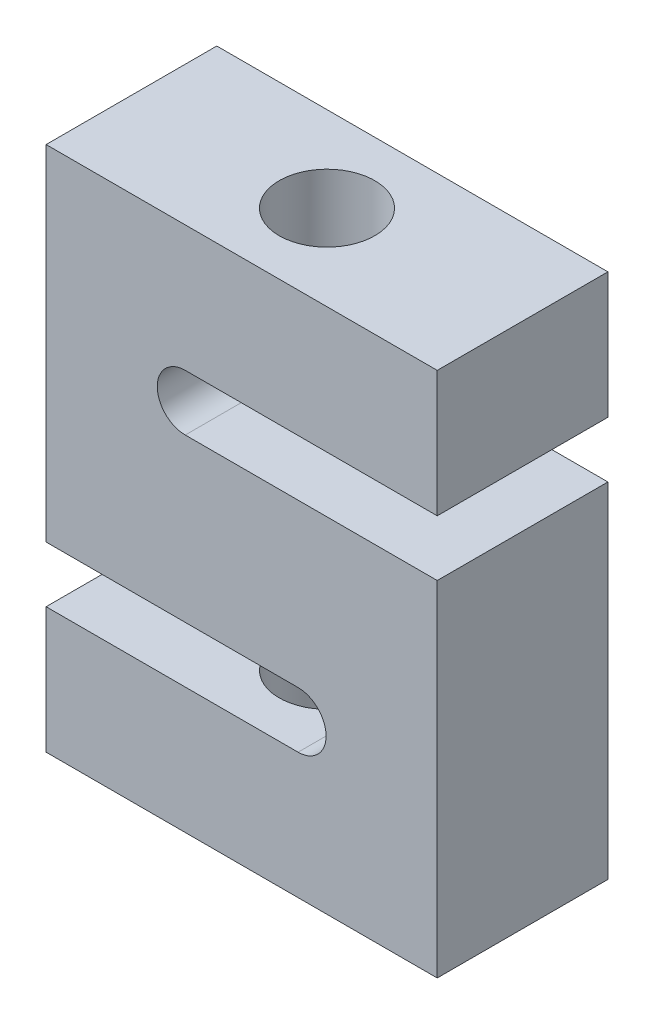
from build123d import *

# Parameters (mm, degrees)
BOSS_EXTRUDE1_DEPTH           = 30.48
F_1_1_2_6_TAPPED_HOLE1_REACH  = 204.823
F_1_1_2_6_TAPPED_HOLE1_BORE_R = 17.06626


with BuildPart() as part:
    # Sketch2 → Boss-Extrude1 (new, symmetric)
    with BuildSketch(Plane.XY):
        with BuildLine():
            Line((-69.85, 93.98), (69.85, 93.98))
            Line((69.85, 93.98), (69.85, 48.98))
            Line((69.85, 48.98), (-20.15, 48.98))
            ThreePointArc((-20.15, 48.98), (-30.15, 38.98), (-20.15, 28.98))
            Line((-20.15, 28.98), (69.85, 28.98))
            Line((69.85, 28.98), (69.85, -93.98))
            Line((69.85, -93.98), (-69.85, -93.98))
            Line((-69.85, -93.98), (-69.85, -48.98))
            Line((-69.85, -48.98), (20.15, -48.98))
            ThreePointArc((20.15, -48.98), (30.15, -38.98), (20.15, -28.98))
            Line((20.15, -28.98), (-69.85, -28.98))
            Line((-69.85, -28.98), (-69.85, 93.98))
        make_face()
    extrude(amount=BOSS_EXTRUDE1_DEPTH, both=True)

    # 1-1_2-6 Tapped Hole1 bore → 1-1_2-6 Tapped Hole1 (cut, up to next)
    with BuildSketch(Plane(origin=(0, 93.98, 0), x_dir=(1, 0, 0), z_dir=(0, 1, 0)), mode=Mode.PRIVATE) as f_1_1_2_6_tapped_hole1_sk1:
        Circle(F_1_1_2_6_TAPPED_HOLE1_BORE_R)
    f_1_1_2_6_tapped_hole1_tool1 = extrude(f_1_1_2_6_tapped_hole1_sk1.sketch, amount=-F_1_1_2_6_TAPPED_HOLE1_REACH, mode=Mode.PRIVATE) & part.part
    f_1_1_2_6_tapped_hole1 = f_1_1_2_6_tapped_hole1_tool1.solids().sort_by_distance((0, 93.98, 0))[0]
    add(f_1_1_2_6_tapped_hole1, mode=Mode.SUBTRACT)

    # Mirror1: 1-1_2-6 Tapped Hole1 across plane
    add(f_1_1_2_6_tapped_hole1.mirror(Plane.ZX), mode=Mode.SUBTRACT)


solid = part.part
